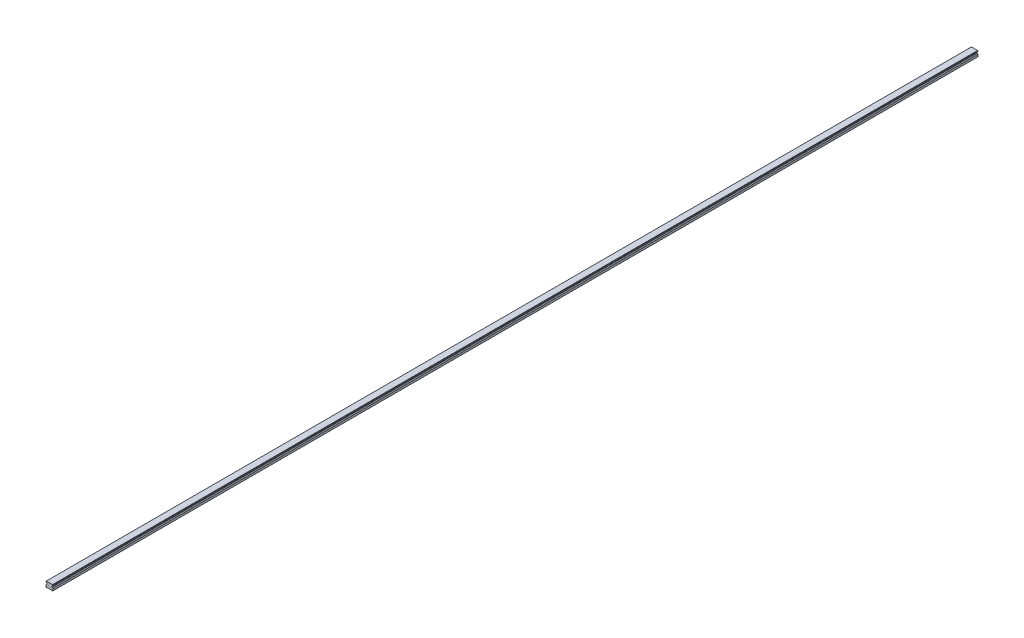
from build123d import *

# Parameters (mm, degrees)
SKETCH1_W           = 20
SKETCH1_H           = 16.3
BOSS_EXTRUDE1_DEPTH = 1340
CUT_EXTRUDE1_DEPTH  = 2681.068224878
CHAMFER1_SIZE       = 1
FILLET1_R           = 1
CUT_EXTRUDE2_DEPTH  = 2681.068224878
SKETCH5_R           = 3
SKETCH5_R_2         = 2.5
CUT_EXTRUDE5_DEPTH  = 10
SKETCH5_2_R         = 2.5
CUT_EXTRUDE6_DEPTH  = 13
LPATTERN2_COUNT     = 45
LPATTERN2_PITCH     = 60


with BuildPart() as part:
    # Sketch1 → Boss-Extrude1 (new, symmetric)
    with BuildSketch(Plane.XY):
        with Locations((0, 8.15)):
            Rectangle(SKETCH1_W, SKETCH1_H)
    extrude(amount=BOSS_EXTRUDE1_DEPTH, both=True)

    # Sketch2 → Cut-Extrude1 (cut, through all)
    with BuildSketch(Plane.XY.offset(1340)):
        Polygon((-10, 14.3), (-10, 7.3), (-7.666666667, 9.633333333), (-7.666666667, 11.966666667), align=None)
        Polygon((7.666666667, 11.966666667), (10, 14.3), (10, 7.3), (7.666666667, 9.633333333), align=None)
    extrude(amount=-CUT_EXTRUDE1_DEPTH, mode=Mode.SUBTRACT)

    # Chamfer1
    chamfer1_edges = [part.edges().sort_by_distance(p)[0] for p in [
        (-10, 16.3, 0),
        (10, 16.3, 0),
        (10, 0, 0),
        (-10, 0, 0),
    ]]
    chamfer(chamfer1_edges, length=CHAMFER1_SIZE)

    # Fillet1
    fillet1_edges = [part.edges().sort_by_distance(p)[0] for p in [
        (-7.666666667, 11.966666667, 0),
        (-7.666666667, 9.633333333, 0),
        (7.666666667, 9.633333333, 0),
        (7.666666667, 11.966666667, 0),
    ]]
    fillet(fillet1_edges, radius=FILLET1_R)

    # Sketch3 → Cut-Extrude2 (cut, through all)
    with BuildSketch(Plane.XY.offset(1340)):
        Polygon((-6, 0), (-5, 1), (5, 1), (6, 0), align=None)
    extrude(amount=-CUT_EXTRUDE2_DEPTH, mode=Mode.SUBTRACT)

    # Sketch5 → Cut-Extrude5 (cut)
    with BuildSketch(Plane.XZ.offset(-1)):
        with Locations(Location((0, 1320, 0), (0, 0, 270))):
            Circle(SKETCH5_R)
        with Locations(Location((0, 1320, 0), (0, 0, 270))):
            Circle(SKETCH5_R_2, mode=Mode.SUBTRACT)
    cut_extrude5 = extrude(amount=-CUT_EXTRUDE5_DEPTH, mode=Mode.SUBTRACT)

    # Sketch5_2 → Cut-Extrude6 (cut)
    with BuildSketch(Plane.XZ.offset(-1)):
        with Locations(Location((0, 1320, 0), (0, 0, 270))):
            Circle(SKETCH5_2_R)
    cut_extrude6 = extrude(amount=-CUT_EXTRUDE6_DEPTH, mode=Mode.SUBTRACT)

    # Cut-Extrude7 cone 1 section (on through the dimple's axis) → Cut-Extrude7 (revolve, cut)
    with BuildSketch(Plane(origin=(0, 14, 1320), x_dir=(0, 0, -1), z_dir=(1, 0, 0))):
        Polygon((0, 0), (2.5, 0), (0, 1.443375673), align=None)
    cut_extrude7 = revolve(axis=Axis((0, 14, 1320), (0, 1, 0)), mode=Mode.SUBTRACT)

    # LPattern2: Cut-Extrude5, Cut-Extrude6, Cut-Extrude7 ×45
    with Locations(*[(0, 0, -i * LPATTERN2_PITCH) for i in range(1, LPATTERN2_COUNT)]):
        add(cut_extrude5, mode=Mode.SUBTRACT)
        add(cut_extrude6, mode=Mode.SUBTRACT)
        add(cut_extrude7, mode=Mode.SUBTRACT)


solid = part.part
